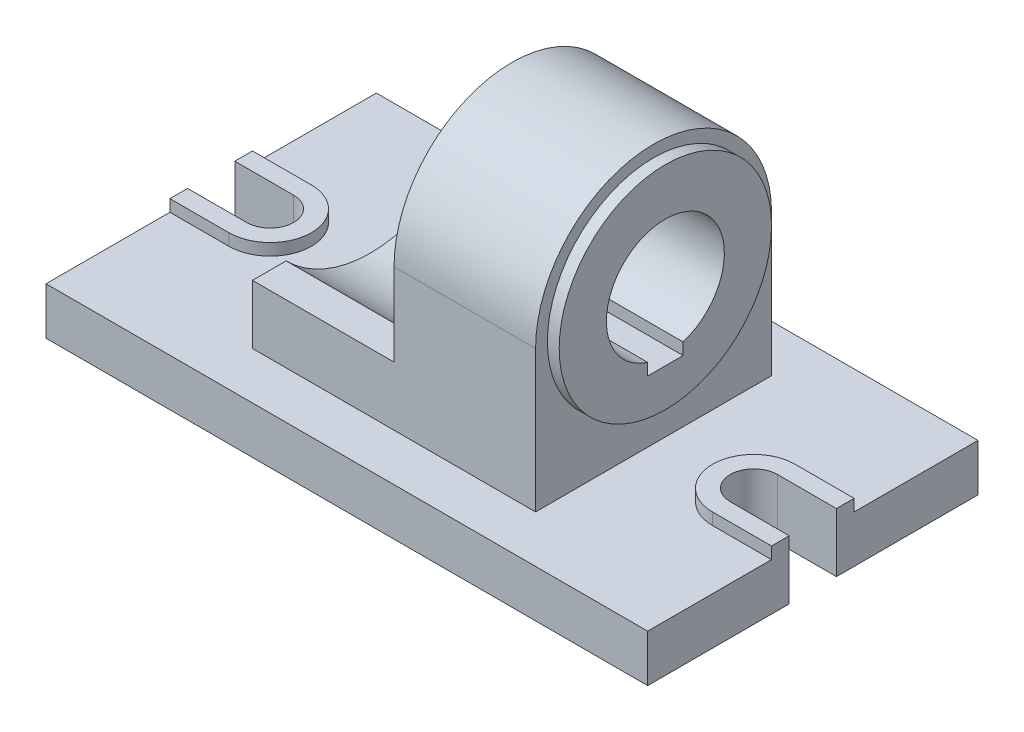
from build123d import *

# Parameters (mm, degrees)
EXTRUDE_1_DEPTH = 8
EXTRUDE_2_DEPTH = 2
EXTRUDE_3_DEPTH = 24
EXTRUDE_START   = 24
EXTRUDE_4_DEPTH = 24
SKETCH_5_R      = 18
EXTRUDE_5_DEPTH = 2


with BuildPart() as part:
    # Sketch 1 → Extrude 1 (new body)
    with BuildSketch(Plane(origin=(0, 0, 0), x_dir=(1, 0, 0), z_dir=(0, 1, 0))):
        with BuildLine():
            Line((41, 4), (51, 4))
            Line((51, 4), (51, 28))
            Line((51, 28), (-51, 28))
            Line((-51, 28), (-51, 4))
            Line((-51, 4), (-41, 4))
            ThreePointArc((-41, 4), (-37, 0), (-41, -4))
            Line((-41, -4), (-51, -4))
            Line((-51, -4), (-51, -28))
            Line((-51, -28), (51, -28))
            Line((51, -28), (51, -4))
            Line((51, -4), (41, -4))
            ThreePointArc((41, -4), (37, 0), (41, 4))
        make_face()
    extrude(amount=EXTRUDE_1_DEPTH)

    # Sketch 2 → Extrude 2 (add)
    with BuildSketch(Plane(origin=(0, 8, 0), x_dir=(1, 0, 0), z_dir=(0, 1, 0))):
        with BuildLine():
            Line((41, 7), (51, 7))
            Line((51, 7), (51, 4))
            Line((51, 4), (46.744562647, 4))
            Line((46.744562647, 4), (41, 4))
            ThreePointArc((41, 4), (37, 0), (41, -4))
            Line((41, -4), (51, -4))
            Line((51, -4), (51, -7))
            Line((51, -7), (41, -7))
            ThreePointArc((41, -7), (34, 0), (41, 7))
        make_face()
        with BuildLine():
            Line((-46.744562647, 4), (-41, 4))
            ThreePointArc((-41, 4), (-37, 0), (-41, -4))
            Line((-41, -4), (-51, -4))
            Line((-51, -4), (-51, -7))
            Line((-51, -7), (-41, -7))
            ThreePointArc((-41, -7), (-34, 0), (-41, 7))
            Line((-41, 7), (-51, 7))
            Line((-51, 7), (-51, 4))
            Line((-51, 4), (-46.744562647, 4))
        make_face()
    extrude(amount=EXTRUDE_2_DEPTH)

    # Sketch 3 → Extrude 3 (add)
    with BuildSketch(Plane(origin=(0, 0, 0), x_dir=(0, 0, -1), z_dir=(1, 0, 0))):
        with BuildLine():
            Line((20, 32), (20, 8))
            Line((20, 8), (-20, 8))
            Line((-20, 8), (-20, 32))
            ThreePointArc((-20, 32), (0, 52), (20, 32))
        make_face()
        with BuildLine():
            Line((-3, 22.460607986), (-3, 20.460607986))
            Line((-3, 20.460607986), (3, 20.460607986))
            Line((3, 20.460607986), (3, 22.460607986))
            ThreePointArc((3, 22.460607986), (0, 42), (-3, 22.460607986))
        make_face(mode=Mode.SUBTRACT)
    extrude(amount=EXTRUDE_3_DEPTH)

    # Sketch 4 → Extrude 4 (add)
    with BuildSketch(Plane.ZY.offset(EXTRUDE_START)):
        with BuildLine():
            Line((20, 8), (20, 18))
            Line((20, 18), (14.282856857, 18))
            ThreePointArc((14.282856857, 18), (0, 12), (-14.282856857, 18))
            Line((-14.282856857, 18), (-20, 18))
            Line((-20, 18), (-20, 8))
            Line((-20, 8), (20, 8))
        make_face()
    extrude(amount=-EXTRUDE_4_DEPTH)

    # Sketch 5 → Extrude 5 (add)
    with BuildSketch(Plane(origin=(24, 0, 0), x_dir=(0, 0, -1), z_dir=(1, 0, 0))):
        with Locations((0, 32)):
            Circle(SKETCH_5_R)
        with BuildLine():
            Line((3, 22.460607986), (3, 20.460607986))
            Line((3, 20.460607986), (-3, 20.460607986))
            Line((-3, 20.460607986), (-3, 22.460607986))
            ThreePointArc((-3, 22.460607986), (0, 42), (3, 22.460607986))
        make_face(mode=Mode.SUBTRACT)
    extrude(amount=EXTRUDE_5_DEPTH)


solid = part.part
